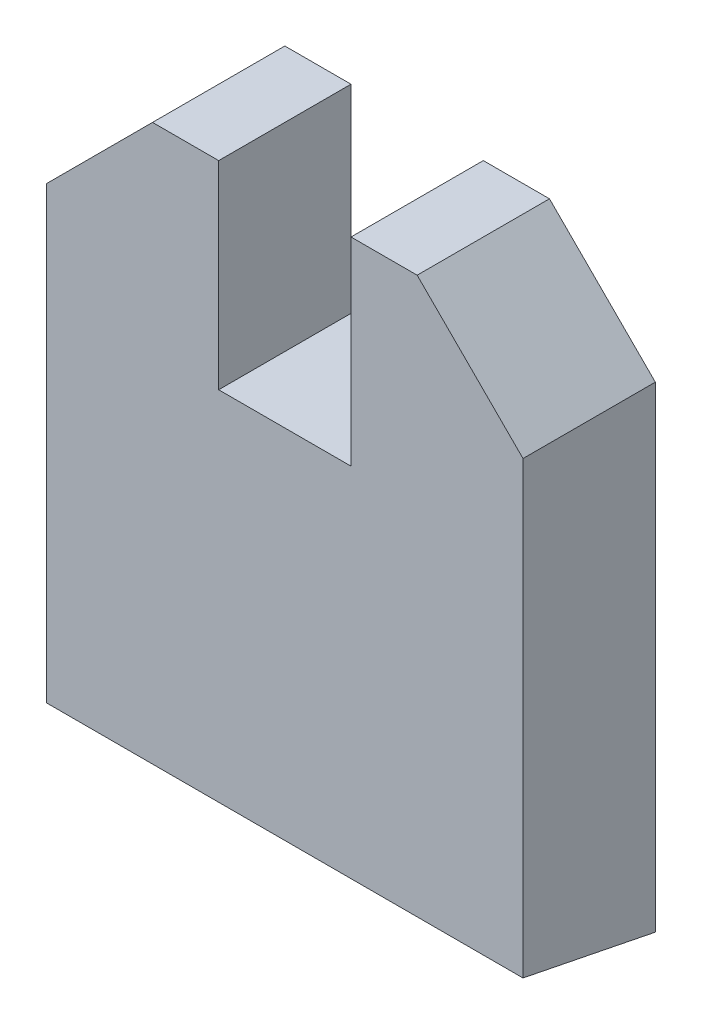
from build123d import *

# Parameters (mm, degrees)
EXTRUSION1_DEPTH        = 5
ENL_V_MAT_EXTRU_1_DEPTH = 29.861739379


with BuildPart() as part:
    # Esquisse1 → Extrusion1 (new body)
    with BuildSketch(Plane.XY):
        Polygon((-9, 0), (9, 0), (9, 18), (5, 22), (2.5, 22), (2.5, 14.5), (-2.5, 14.5), (-2.5, 22), (-5, 22), (-9, 18), align=None)
    extrude(amount=EXTRUSION1_DEPTH)

    # Esquisse2 → Enl_v. mat.-Extru.1 (cut, through all)
    with BuildSketch(Plane(origin=(9, 0, 0), x_dir=(0, 0, -1), z_dir=(1, 0, 0))):
        Polygon((0, 0), (-5, 1), (-5, 0), align=None)
    extrude(amount=-ENL_V_MAT_EXTRU_1_DEPTH, mode=Mode.SUBTRACT)


solid = part.part
